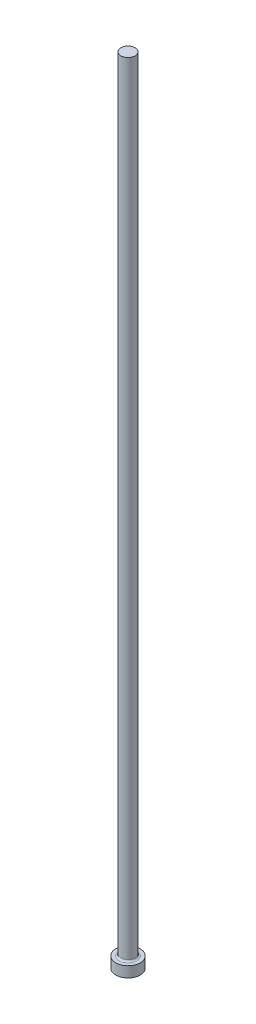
ISO-10303-21;
HEADER;
FILE_DESCRIPTION(('STEP AP214'),'2;1');
FILE_NAME('part.step','',(''),(''),'','','');
FILE_SCHEMA(('AUTOMOTIVE_DESIGN { 1 0 10303 214 1 1 1 1 }'));
ENDSEC;
DATA;
#1=APPLICATION_CONTEXT('core data for automotive mechanical design processes');
#2=APPLICATION_PROTOCOL_DEFINITION('international standard','automotive_design',2000,#1);
#3=PRODUCT_CONTEXT('',#1,'mechanical');
#4=PRODUCT('Part','Part','',(#3));
#5=PRODUCT_RELATED_PRODUCT_CATEGORY('part','',(#4));
#6=PRODUCT_DEFINITION_FORMATION('','',#4);
#7=PRODUCT_DEFINITION_CONTEXT('part definition',#1,'design');
#8=PRODUCT_DEFINITION('design','',#6,#7);
#9=PRODUCT_DEFINITION_SHAPE('','',#8);
#10=(LENGTH_UNIT() NAMED_UNIT(*) SI_UNIT(.MILLI.,.METRE.));
#11=(NAMED_UNIT(*) PLANE_ANGLE_UNIT() SI_UNIT($,.RADIAN.));
#12=(NAMED_UNIT(*) SI_UNIT($,.STERADIAN.) SOLID_ANGLE_UNIT());
#13=UNCERTAINTY_MEASURE_WITH_UNIT(LENGTH_MEASURE(1.E-05),#10,'distance_accuracy_value','');
#14=(GEOMETRIC_REPRESENTATION_CONTEXT(3) GLOBAL_UNCERTAINTY_ASSIGNED_CONTEXT((#13)) GLOBAL_UNIT_ASSIGNED_CONTEXT((#10,
#11,#12)) REPRESENTATION_CONTEXT('',''));
#15=CARTESIAN_POINT('',(0.,0.,0.));
#16=DIRECTION('',(0.,0.,1.));
#17=DIRECTION('',(1.,0.,0.));
#18=AXIS2_PLACEMENT_3D('',#15,#16,#17);
#19=CARTESIAN_POINT('',(3.17499999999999,355.6,0.));
#20=DIRECTION('',(0.,-1.,0.));
#21=DIRECTION('',(1.,0.,0.));
#22=AXIS2_PLACEMENT_3D('',#19,#20,#21);
#23=PLANE('',#22);
#24=CARTESIAN_POINT('',(0.,355.6,0.));
#25=DIRECTION('',(0.,1.,0.));
#26=DIRECTION('',(-1.,0.,0.));
#27=AXIS2_PLACEMENT_3D('',#24,#25,#26);
#28=CIRCLE('',#27,3.175);
#29=CARTESIAN_POINT('',(-3.17500000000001,355.6,0.));
#30=VERTEX_POINT('',#29);
#31=EDGE_CURVE('E10',#30,#30,#28,.T.);
#32=ORIENTED_EDGE('',*,*,#31,.T.);
#33=EDGE_LOOP('',(#32));
#34=FACE_BOUND('',#33,.T.);
#35=ADVANCED_FACE('F30',(#34),#23,.F.);
#36=CARTESIAN_POINT('',(0.,355.6,0.));
#37=DIRECTION('',(0.,1.,0.));
#38=DIRECTION('',(-1.,0.,0.));
#39=AXIS2_PLACEMENT_3D('',#36,#37,#38);
#40=CYLINDRICAL_SURFACE('',#39,3.175);
#41=ORIENTED_EDGE('',*,*,#31,.F.);
#42=EDGE_LOOP('',(#41));
#43=FACE_BOUND('',#42,.T.);
#44=CARTESIAN_POINT('',(0.,5.51180000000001,0.));
#45=DIRECTION('',(0.,1.,0.));
#46=DIRECTION('',(-1.,0.,0.));
#47=AXIS2_PLACEMENT_3D('',#44,#45,#46);
#48=CIRCLE('',#47,3.175);
#49=CARTESIAN_POINT('',(-3.175,5.51180000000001,0.));
#50=VERTEX_POINT('',#49);
#51=EDGE_CURVE('E36',#50,#50,#48,.T.);
#52=ORIENTED_EDGE('',*,*,#51,.T.);
#53=EDGE_LOOP('',(#52));
#54=FACE_BOUND('',#53,.T.);
#55=ADVANCED_FACE('F65',(#43,#54),#40,.T.);
#56=CARTESIAN_POINT('',(0.,5.5118,0.));
#57=DIRECTION('',(0.,1.,0.));
#58=DIRECTION('',(-1.,0.,0.));
#59=AXIS2_PLACEMENT_3D('',#56,#57,#58);
#60=TOROIDAL_SURFACE('',#59,3.937,0.762);
#61=ORIENTED_EDGE('',*,*,#51,.F.);
#62=EDGE_LOOP('',(#61));
#63=FACE_BOUND('',#62,.T.);
#64=CARTESIAN_POINT('',(0.,4.74980000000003,0.));
#65=DIRECTION('',(0.,1.,0.));
#66=DIRECTION('',(-1.,0.,0.));
#67=AXIS2_PLACEMENT_3D('',#64,#65,#66);
#68=CIRCLE('',#67,3.937);
#69=CARTESIAN_POINT('',(-3.937,4.74980000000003,0.));
#70=VERTEX_POINT('',#69);
#71=EDGE_CURVE('E40',#70,#70,#68,.T.);
#72=ORIENTED_EDGE('',*,*,#71,.T.);
#73=EDGE_LOOP('',(#72));
#74=FACE_BOUND('',#73,.T.);
#75=ADVANCED_FACE('F69',(#63,#74),#60,.F.);
#76=CARTESIAN_POINT('',(5.461,4.7498,0.));
#77=DIRECTION('',(0.,-1.,0.));
#78=DIRECTION('',(1.,0.,0.));
#79=AXIS2_PLACEMENT_3D('',#76,#77,#78);
#80=PLANE('',#79);
#81=ORIENTED_EDGE('',*,*,#71,.F.);
#82=EDGE_LOOP('',(#81));
#83=FACE_BOUND('',#82,.T.);
#84=CARTESIAN_POINT('',(0.,4.74980000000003,0.));
#85=DIRECTION('',(0.,1.,0.));
#86=DIRECTION('',(-1.,0.,0.));
#87=AXIS2_PLACEMENT_3D('',#84,#85,#86);
#88=CIRCLE('',#87,5.461);
#89=CARTESIAN_POINT('',(-5.461,4.74980000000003,0.));
#90=VERTEX_POINT('',#89);
#91=EDGE_CURVE('E44',#90,#90,#88,.T.);
#92=ORIENTED_EDGE('',*,*,#91,.T.);
#93=EDGE_LOOP('',(#92));
#94=FACE_BOUND('',#93,.T.);
#95=ADVANCED_FACE('F61',(#83,#94),#80,.F.);
#96=CARTESIAN_POINT('',(0.,355.6,0.));
#97=DIRECTION('',(0.,1.,0.));
#98=DIRECTION('',(-1.,0.,0.));
#99=AXIS2_PLACEMENT_3D('',#96,#97,#98);
#100=CYLINDRICAL_SURFACE('',#99,5.461);
#101=ORIENTED_EDGE('',*,*,#91,.F.);
#102=EDGE_LOOP('',(#101));
#103=FACE_BOUND('',#102,.T.);
#104=CARTESIAN_POINT('',(0.,0.,0.));
#105=DIRECTION('',(0.,1.,0.));
#106=DIRECTION('',(-1.,0.,0.));
#107=AXIS2_PLACEMENT_3D('',#104,#105,#106);
#108=CIRCLE('',#107,5.461);
#109=CARTESIAN_POINT('',(-5.461,0.,0.));
#110=VERTEX_POINT('',#109);
#111=EDGE_CURVE('E49',#110,#110,#108,.T.);
#112=ORIENTED_EDGE('',*,*,#111,.T.);
#113=EDGE_LOOP('',(#112));
#114=FACE_BOUND('',#113,.T.);
#115=ADVANCED_FACE('F53',(#103,#114),#100,.T.);
#116=CARTESIAN_POINT('',(0.,0.,0.));
#117=DIRECTION('',(0.,1.,0.));
#118=DIRECTION('',(-1.,0.,0.));
#119=AXIS2_PLACEMENT_3D('',#116,#117,#118);
#120=PLANE('',#119);
#121=ORIENTED_EDGE('',*,*,#111,.F.);
#122=EDGE_LOOP('',(#121));
#123=FACE_BOUND('',#122,.T.);
#124=ADVANCED_FACE('F55',(#123),#120,.F.);
#125=CLOSED_SHELL('',(#35,#55,#75,#95,#115,#124));
#126=MANIFOLD_SOLID_BREP('B2',#125);
#127=ADVANCED_BREP_SHAPE_REPRESENTATION('',(#18,#126),#14);
#128=SHAPE_DEFINITION_REPRESENTATION(#9,#127);
ENDSEC;
END-ISO-10303-21;
